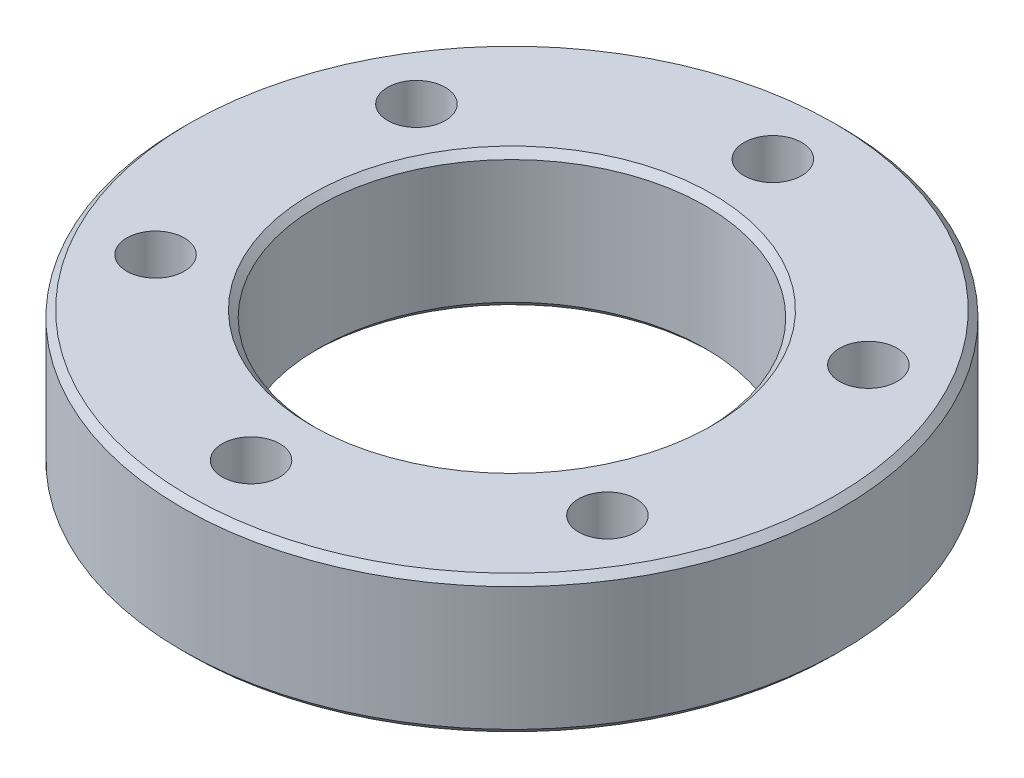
ISO-10303-21;
HEADER;
FILE_DESCRIPTION(('STEP AP214'),'2;1');
FILE_NAME('part.step','',(''),(''),'','','');
FILE_SCHEMA(('AUTOMOTIVE_DESIGN { 1 0 10303 214 1 1 1 1 }'));
ENDSEC;
DATA;
#1=APPLICATION_CONTEXT('core data for automotive mechanical design processes');
#2=APPLICATION_PROTOCOL_DEFINITION('international standard','automotive_design',2000,#1);
#3=PRODUCT_CONTEXT('',#1,'mechanical');
#4=PRODUCT('Part','Part','',(#3));
#5=PRODUCT_RELATED_PRODUCT_CATEGORY('part','',(#4));
#6=PRODUCT_DEFINITION_FORMATION('','',#4);
#7=PRODUCT_DEFINITION_CONTEXT('part definition',#1,'design');
#8=PRODUCT_DEFINITION('design','',#6,#7);
#9=PRODUCT_DEFINITION_SHAPE('','',#8);
#10=(LENGTH_UNIT() NAMED_UNIT(*) SI_UNIT(.MILLI.,.METRE.));
#11=(NAMED_UNIT(*) PLANE_ANGLE_UNIT() SI_UNIT($,.RADIAN.));
#12=(NAMED_UNIT(*) SI_UNIT($,.STERADIAN.) SOLID_ANGLE_UNIT());
#13=UNCERTAINTY_MEASURE_WITH_UNIT(LENGTH_MEASURE(1.E-05),#10,'distance_accuracy_value','');
#14=(GEOMETRIC_REPRESENTATION_CONTEXT(3) GLOBAL_UNCERTAINTY_ASSIGNED_CONTEXT((#13)) GLOBAL_UNIT_ASSIGNED_CONTEXT((#10,
#11,#12)) REPRESENTATION_CONTEXT('',''));
#15=CARTESIAN_POINT('',(0.,0.,0.));
#16=DIRECTION('',(0.,0.,1.));
#17=DIRECTION('',(1.,0.,0.));
#18=AXIS2_PLACEMENT_3D('',#15,#16,#17);
#19=CARTESIAN_POINT('',(0.,10.,0.));
#20=DIRECTION('',(0.,1.,0.));
#21=DIRECTION('',(0.,0.,1.));
#22=AXIS2_PLACEMENT_3D('',#19,#20,#21);
#23=PLANE('',#22);
#24=CARTESIAN_POINT('',(0.,10.,0.));
#25=DIRECTION('',(0.,1.,0.));
#26=DIRECTION('',(0.,0.,1.));
#27=AXIS2_PLACEMENT_3D('',#24,#25,#26);
#28=CIRCLE('',#27,23.5);
#29=CARTESIAN_POINT('',(0.,10.,23.5));
#30=VERTEX_POINT('',#29);
#31=EDGE_CURVE('E54',#30,#30,#28,.T.);
#32=ORIENTED_EDGE('',*,*,#31,.T.);
#33=EDGE_LOOP('',(#32));
#34=FACE_BOUND('',#33,.T.);
#35=CARTESIAN_POINT('',(0.,10.,0.));
#36=DIRECTION('',(0.,1.,0.));
#37=DIRECTION('',(0.,0.,1.));
#38=AXIS2_PLACEMENT_3D('',#35,#36,#37);
#39=CIRCLE('',#38,14.6);
#40=CARTESIAN_POINT('',(0.,10.,14.6));
#41=VERTEX_POINT('',#40);
#42=EDGE_CURVE('E58',#41,#41,#39,.F.);
#43=ORIENTED_EDGE('',*,*,#42,.T.);
#44=EDGE_LOOP('',(#43));
#45=FACE_BOUND('',#44,.T.);
#46=CARTESIAN_POINT('',(-16.4544826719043,10.0000000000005,-9.50000000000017));
#47=DIRECTION('',(0.,1.,0.));
#48=DIRECTION('',(0.,0.,1.));
#49=AXIS2_PLACEMENT_3D('',#46,#47,#48);
#50=CIRCLE('',#49,2.1);
#51=CARTESIAN_POINT('',(-16.4544826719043,10.0000000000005,-7.40000000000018));
#52=VERTEX_POINT('',#51);
#53=EDGE_CURVE('E108',#52,#52,#50,.T.);
#54=ORIENTED_EDGE('',*,*,#53,.F.);
#55=EDGE_LOOP('',(#54));
#56=FACE_BOUND('',#55,.T.);
#57=CARTESIAN_POINT('',(-16.4544826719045,10.0000000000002,9.49999999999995));
#58=DIRECTION('',(0.,1.,0.));
#59=DIRECTION('',(0.,0.,1.));
#60=AXIS2_PLACEMENT_3D('',#57,#58,#59);
#61=CIRCLE('',#60,2.1);
#62=CARTESIAN_POINT('',(-16.4544826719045,10.0000000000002,11.6));
#63=VERTEX_POINT('',#62);
#64=EDGE_CURVE('E102',#63,#63,#61,.T.);
#65=ORIENTED_EDGE('',*,*,#64,.F.);
#66=EDGE_LOOP('',(#65));
#67=FACE_BOUND('',#66,.T.);
#68=CARTESIAN_POINT('',(0.,10.0000000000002,19.0000000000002));
#69=DIRECTION('',(0.,1.,0.));
#70=DIRECTION('',(0.,0.,1.));
#71=AXIS2_PLACEMENT_3D('',#68,#69,#70);
#72=CIRCLE('',#71,2.1);
#73=CARTESIAN_POINT('',(0.,10.0000000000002,21.1000000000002));
#74=VERTEX_POINT('',#73);
#75=EDGE_CURVE('E96',#74,#74,#72,.T.);
#76=ORIENTED_EDGE('',*,*,#75,.F.);
#77=EDGE_LOOP('',(#76));
#78=FACE_BOUND('',#77,.T.);
#79=CARTESIAN_POINT('',(16.4544826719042,10.,9.50000000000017));
#80=DIRECTION('',(0.,1.,0.));
#81=DIRECTION('',(0.,0.,1.));
#82=AXIS2_PLACEMENT_3D('',#79,#80,#81);
#83=CIRCLE('',#82,2.1);
#84=CARTESIAN_POINT('',(16.4544826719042,10.,11.6000000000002));
#85=VERTEX_POINT('',#84);
#86=EDGE_CURVE('E90',#85,#85,#83,.T.);
#87=ORIENTED_EDGE('',*,*,#86,.F.);
#88=EDGE_LOOP('',(#87));
#89=FACE_BOUND('',#88,.T.);
#90=CARTESIAN_POINT('',(16.4544826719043,10.,-9.49999999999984));
#91=DIRECTION('',(0.,1.,0.));
#92=DIRECTION('',(0.,0.,1.));
#93=AXIS2_PLACEMENT_3D('',#90,#91,#92);
#94=CIRCLE('',#93,2.1);
#95=CARTESIAN_POINT('',(16.4544826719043,10.,-7.39999999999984));
#96=VERTEX_POINT('',#95);
#97=EDGE_CURVE('E84',#96,#96,#94,.T.);
#98=ORIENTED_EDGE('',*,*,#97,.F.);
#99=EDGE_LOOP('',(#98));
#100=FACE_BOUND('',#99,.T.);
#101=CARTESIAN_POINT('',(0.,10.,-19.));
#102=DIRECTION('',(0.,1.,0.));
#103=DIRECTION('',(0.,0.,1.));
#104=AXIS2_PLACEMENT_3D('',#101,#102,#103);
#105=CIRCLE('',#104,2.1);
#106=CARTESIAN_POINT('',(0.,10.,-16.9));
#107=VERTEX_POINT('',#106);
#108=EDGE_CURVE('E78',#107,#107,#105,.T.);
#109=ORIENTED_EDGE('',*,*,#108,.F.);
#110=EDGE_LOOP('',(#109));
#111=FACE_BOUND('',#110,.T.);
#112=ADVANCED_FACE('F43',(#34,#45,#56,#67,#78,#89,#100,#111),#23,.T.);
#113=CARTESIAN_POINT('',(0.,0.,0.));
#114=DIRECTION('',(0.,1.,0.));
#115=DIRECTION('',(0.,0.,1.));
#116=AXIS2_PLACEMENT_3D('',#113,#114,#115);
#117=PLANE('',#116);
#118=CARTESIAN_POINT('',(0.,0.,0.));
#119=DIRECTION('',(0.,1.,0.));
#120=DIRECTION('',(0.,0.,1.));
#121=AXIS2_PLACEMENT_3D('',#118,#119,#120);
#122=CIRCLE('',#121,23.5);
#123=CARTESIAN_POINT('',(0.,0.,23.5));
#124=VERTEX_POINT('',#123);
#125=EDGE_CURVE('E63',#124,#124,#122,.F.);
#126=ORIENTED_EDGE('',*,*,#125,.T.);
#127=EDGE_LOOP('',(#126));
#128=FACE_BOUND('',#127,.T.);
#129=CARTESIAN_POINT('',(0.,0.,0.));
#130=DIRECTION('',(0.,1.,0.));
#131=DIRECTION('',(0.,0.,1.));
#132=AXIS2_PLACEMENT_3D('',#129,#130,#131);
#133=CIRCLE('',#132,14.6);
#134=CARTESIAN_POINT('',(0.,0.,14.6));
#135=VERTEX_POINT('',#134);
#136=EDGE_CURVE('E66',#135,#135,#133,.T.);
#137=ORIENTED_EDGE('',*,*,#136,.T.);
#138=EDGE_LOOP('',(#137));
#139=FACE_BOUND('',#138,.T.);
#140=CARTESIAN_POINT('',(-16.4544826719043,4.44089209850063E-13,-9.50000000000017));
#141=DIRECTION('',(0.,1.,0.));
#142=DIRECTION('',(0.,0.,1.));
#143=AXIS2_PLACEMENT_3D('',#140,#141,#142);
#144=CIRCLE('',#143,2.1);
#145=CARTESIAN_POINT('',(-16.4544826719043,4.43883065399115E-13,-7.40000000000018));
#146=VERTEX_POINT('',#145);
#147=EDGE_CURVE('E105',#146,#146,#144,.T.);
#148=ORIENTED_EDGE('',*,*,#147,.T.);
#149=EDGE_LOOP('',(#148));
#150=FACE_BOUND('',#149,.T.);
#151=CARTESIAN_POINT('',(-16.4544826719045,2.22044604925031E-13,9.49999999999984));
#152=DIRECTION('',(0.,1.,0.));
#153=DIRECTION('',(0.,0.,1.));
#154=AXIS2_PLACEMENT_3D('',#151,#152,#153);
#155=CIRCLE('',#154,2.1);
#156=CARTESIAN_POINT('',(-16.4544826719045,2.21838460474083E-13,11.5999999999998));
#157=VERTEX_POINT('',#156);
#158=EDGE_CURVE('E99',#157,#157,#155,.T.);
#159=ORIENTED_EDGE('',*,*,#158,.T.);
#160=EDGE_LOOP('',(#159));
#161=FACE_BOUND('',#160,.T.);
#162=CARTESIAN_POINT('',(-1.66533453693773E-13,2.22044604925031E-13,19.0000000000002));
#163=DIRECTION('',(0.,1.,0.));
#164=DIRECTION('',(0.,0.,1.));
#165=AXIS2_PLACEMENT_3D('',#162,#163,#164);
#166=CIRCLE('',#165,2.1);
#167=CARTESIAN_POINT('',(-1.65600866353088E-13,2.21838460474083E-13,21.1000000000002));
#168=VERTEX_POINT('',#167);
#169=EDGE_CURVE('E93',#168,#168,#166,.T.);
#170=ORIENTED_EDGE('',*,*,#169,.T.);
#171=EDGE_LOOP('',(#170));
#172=FACE_BOUND('',#171,.T.);
#173=CARTESIAN_POINT('',(16.4544826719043,0.,9.50000000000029));
#174=DIRECTION('',(0.,1.,0.));
#175=DIRECTION('',(0.,0.,1.));
#176=AXIS2_PLACEMENT_3D('',#173,#174,#175);
#177=CIRCLE('',#176,2.1);
#178=CARTESIAN_POINT('',(16.4544826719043,0.,11.6000000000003));
#179=VERTEX_POINT('',#178);
#180=EDGE_CURVE('E87',#179,#179,#177,.T.);
#181=ORIENTED_EDGE('',*,*,#180,.T.);
#182=EDGE_LOOP('',(#181));
#183=FACE_BOUND('',#182,.T.);
#184=CARTESIAN_POINT('',(16.4544826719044,0.,-9.49999999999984));
#185=DIRECTION('',(0.,1.,0.));
#186=DIRECTION('',(0.,0.,1.));
#187=AXIS2_PLACEMENT_3D('',#184,#185,#186);
#188=CIRCLE('',#187,2.1);
#189=CARTESIAN_POINT('',(16.4544826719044,0.,-7.39999999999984));
#190=VERTEX_POINT('',#189);
#191=EDGE_CURVE('E81',#190,#190,#188,.T.);
#192=ORIENTED_EDGE('',*,*,#191,.T.);
#193=EDGE_LOOP('',(#192));
#194=FACE_BOUND('',#193,.T.);
#195=CARTESIAN_POINT('',(0.,0.,-19.));
#196=DIRECTION('',(0.,1.,0.));
#197=DIRECTION('',(0.,0.,1.));
#198=AXIS2_PLACEMENT_3D('',#195,#196,#197);
#199=CIRCLE('',#198,2.1);
#200=CARTESIAN_POINT('',(0.,0.,-16.9));
#201=VERTEX_POINT('',#200);
#202=EDGE_CURVE('E75',#201,#201,#199,.T.);
#203=ORIENTED_EDGE('',*,*,#202,.T.);
#204=EDGE_LOOP('',(#203));
#205=FACE_BOUND('',#204,.T.);
#206=ADVANCED_FACE('F116',(#128,#139,#150,#161,#172,#183,#194,#205),#117,.F.);
#207=CARTESIAN_POINT('',(0.,10.,0.));
#208=DIRECTION('',(0.,-1.,0.));
#209=DIRECTION('',(0.,0.,-1.));
#210=AXIS2_PLACEMENT_3D('',#207,#208,#209);
#211=CYLINDRICAL_SURFACE('',#210,24.);
#212=CARTESIAN_POINT('',(0.,0.499999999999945,0.));
#213=DIRECTION('',(0.,1.,0.));
#214=DIRECTION('',(0.,0.,1.));
#215=AXIS2_PLACEMENT_3D('',#212,#213,#214);
#216=CIRCLE('',#215,24.);
#217=CARTESIAN_POINT('',(0.,0.499999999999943,24.));
#218=VERTEX_POINT('',#217);
#219=EDGE_CURVE('E69',#218,#218,#216,.T.);
#220=ORIENTED_EDGE('',*,*,#219,.T.);
#221=EDGE_LOOP('',(#220));
#222=FACE_BOUND('',#221,.T.);
#223=CARTESIAN_POINT('',(0.,9.49999999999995,0.));
#224=DIRECTION('',(0.,1.,0.));
#225=DIRECTION('',(0.,0.,1.));
#226=AXIS2_PLACEMENT_3D('',#223,#224,#225);
#227=CIRCLE('',#226,24.);
#228=CARTESIAN_POINT('',(0.,9.49999999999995,24.));
#229=VERTEX_POINT('',#228);
#230=EDGE_CURVE('E72',#229,#229,#227,.F.);
#231=ORIENTED_EDGE('',*,*,#230,.T.);
#232=EDGE_LOOP('',(#231));
#233=FACE_BOUND('',#232,.T.);
#234=ADVANCED_FACE('F142',(#222,#233),#211,.T.);
#235=CARTESIAN_POINT('',(0.,10.,0.));
#236=DIRECTION('',(0.,-1.,0.));
#237=DIRECTION('',(0.,0.,-1.));
#238=AXIS2_PLACEMENT_3D('',#235,#236,#237);
#239=CYLINDRICAL_SURFACE('',#238,14.1);
#240=CARTESIAN_POINT('',(0.,0.500000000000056,0.));
#241=DIRECTION('',(0.,1.,0.));
#242=DIRECTION('',(0.,0.,1.));
#243=AXIS2_PLACEMENT_3D('',#240,#241,#242);
#244=CIRCLE('',#243,14.1);
#245=CARTESIAN_POINT('',(0.,0.500000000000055,14.1));
#246=VERTEX_POINT('',#245);
#247=EDGE_CURVE('E10',#246,#246,#244,.F.);
#248=ORIENTED_EDGE('',*,*,#247,.T.);
#249=EDGE_LOOP('',(#248));
#250=FACE_BOUND('',#249,.T.);
#251=CARTESIAN_POINT('',(0.,9.50000000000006,0.));
#252=DIRECTION('',(0.,1.,0.));
#253=DIRECTION('',(0.,0.,1.));
#254=AXIS2_PLACEMENT_3D('',#251,#252,#253);
#255=CIRCLE('',#254,14.1);
#256=CARTESIAN_POINT('',(0.,9.50000000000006,14.1));
#257=VERTEX_POINT('',#256);
#258=EDGE_CURVE('E50',#257,#257,#255,.T.);
#259=ORIENTED_EDGE('',*,*,#258,.T.);
#260=EDGE_LOOP('',(#259));
#261=FACE_BOUND('',#260,.T.);
#262=ADVANCED_FACE('F132',(#250,#261),#239,.F.);
#263=CARTESIAN_POINT('',(0.,10.,-19.));
#264=DIRECTION('',(0.,1.,0.));
#265=DIRECTION('',(0.,0.,1.));
#266=AXIS2_PLACEMENT_3D('',#263,#264,#265);
#267=CYLINDRICAL_SURFACE('',#266,2.1);
#268=ORIENTED_EDGE('',*,*,#202,.F.);
#269=EDGE_LOOP('',(#268));
#270=FACE_BOUND('',#269,.T.);
#271=ORIENTED_EDGE('',*,*,#108,.T.);
#272=EDGE_LOOP('',(#271));
#273=FACE_BOUND('',#272,.T.);
#274=ADVANCED_FACE('F129',(#270,#273),#267,.F.);
#275=CARTESIAN_POINT('',(16.4544826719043,10.,-9.49999999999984));
#276=DIRECTION('',(0.,1.,0.));
#277=DIRECTION('',(0.,0.,1.));
#278=AXIS2_PLACEMENT_3D('',#275,#276,#277);
#279=CYLINDRICAL_SURFACE('',#278,2.1);
#280=ORIENTED_EDGE('',*,*,#191,.F.);
#281=EDGE_LOOP('',(#280));
#282=FACE_BOUND('',#281,.T.);
#283=ORIENTED_EDGE('',*,*,#97,.T.);
#284=EDGE_LOOP('',(#283));
#285=FACE_BOUND('',#284,.T.);
#286=ADVANCED_FACE('F131',(#282,#285),#279,.F.);
#287=CARTESIAN_POINT('',(16.4544826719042,10.,9.50000000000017));
#288=DIRECTION('',(0.,1.,0.));
#289=DIRECTION('',(0.,0.,1.));
#290=AXIS2_PLACEMENT_3D('',#287,#288,#289);
#291=CYLINDRICAL_SURFACE('',#290,2.1);
#292=ORIENTED_EDGE('',*,*,#180,.F.);
#293=EDGE_LOOP('',(#292));
#294=FACE_BOUND('',#293,.T.);
#295=ORIENTED_EDGE('',*,*,#86,.T.);
#296=EDGE_LOOP('',(#295));
#297=FACE_BOUND('',#296,.T.);
#298=ADVANCED_FACE('F139',(#294,#297),#291,.F.);
#299=CARTESIAN_POINT('',(0.,10.0000000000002,19.0000000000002));
#300=DIRECTION('',(0.,1.,0.));
#301=DIRECTION('',(0.,0.,1.));
#302=AXIS2_PLACEMENT_3D('',#299,#300,#301);
#303=CYLINDRICAL_SURFACE('',#302,2.1);
#304=ORIENTED_EDGE('',*,*,#169,.F.);
#305=EDGE_LOOP('',(#304));
#306=FACE_BOUND('',#305,.T.);
#307=ORIENTED_EDGE('',*,*,#75,.T.);
#308=EDGE_LOOP('',(#307));
#309=FACE_BOUND('',#308,.T.);
#310=ADVANCED_FACE('F185',(#306,#309),#303,.F.);
#311=CARTESIAN_POINT('',(-16.4544826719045,10.0000000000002,9.49999999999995));
#312=DIRECTION('',(0.,1.,0.));
#313=DIRECTION('',(0.,0.,1.));
#314=AXIS2_PLACEMENT_3D('',#311,#312,#313);
#315=CYLINDRICAL_SURFACE('',#314,2.1);
#316=ORIENTED_EDGE('',*,*,#158,.F.);
#317=EDGE_LOOP('',(#316));
#318=FACE_BOUND('',#317,.T.);
#319=ORIENTED_EDGE('',*,*,#64,.T.);
#320=EDGE_LOOP('',(#319));
#321=FACE_BOUND('',#320,.T.);
#322=ADVANCED_FACE('F189',(#318,#321),#315,.F.);
#323=CARTESIAN_POINT('',(-16.4544826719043,10.0000000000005,-9.50000000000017));
#324=DIRECTION('',(0.,1.,0.));
#325=DIRECTION('',(0.,0.,1.));
#326=AXIS2_PLACEMENT_3D('',#323,#324,#325);
#327=CYLINDRICAL_SURFACE('',#326,2.1);
#328=ORIENTED_EDGE('',*,*,#147,.F.);
#329=EDGE_LOOP('',(#328));
#330=FACE_BOUND('',#329,.T.);
#331=ORIENTED_EDGE('',*,*,#53,.T.);
#332=EDGE_LOOP('',(#331));
#333=FACE_BOUND('',#332,.T.);
#334=ADVANCED_FACE('F112',(#330,#333),#327,.F.);
#335=CARTESIAN_POINT('',(0.,0.499999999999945,0.));
#336=DIRECTION('',(0.,1.,0.));
#337=DIRECTION('',(0.,0.,1.));
#338=AXIS2_PLACEMENT_3D('',#335,#336,#337);
#339=CONICAL_SURFACE('',#338,24.,0.785398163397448);
#340=ORIENTED_EDGE('',*,*,#125,.F.);
#341=EDGE_LOOP('',(#340));
#342=FACE_BOUND('',#341,.T.);
#343=ORIENTED_EDGE('',*,*,#219,.F.);
#344=EDGE_LOOP('',(#343));
#345=FACE_BOUND('',#344,.T.);
#346=ADVANCED_FACE('F153',(#342,#345),#339,.T.);
#347=CARTESIAN_POINT('',(0.,10.,0.));
#348=DIRECTION('',(0.,-1.,0.));
#349=DIRECTION('',(0.,0.,-1.));
#350=AXIS2_PLACEMENT_3D('',#347,#348,#349);
#351=CONICAL_SURFACE('',#350,23.5,0.785398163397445);
#352=ORIENTED_EDGE('',*,*,#230,.F.);
#353=EDGE_LOOP('',(#352));
#354=FACE_BOUND('',#353,.T.);
#355=ORIENTED_EDGE('',*,*,#31,.F.);
#356=EDGE_LOOP('',(#355));
#357=FACE_BOUND('',#356,.T.);
#358=ADVANCED_FACE('F156',(#354,#357),#351,.T.);
#359=CARTESIAN_POINT('',(0.,0.,0.));
#360=DIRECTION('',(0.,-1.,0.));
#361=DIRECTION('',(0.,0.,-1.));
#362=AXIS2_PLACEMENT_3D('',#359,#360,#361);
#363=CONICAL_SURFACE('',#362,14.6,0.785398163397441);
#364=ORIENTED_EDGE('',*,*,#247,.F.);
#365=EDGE_LOOP('',(#364));
#366=FACE_BOUND('',#365,.T.);
#367=ORIENTED_EDGE('',*,*,#136,.F.);
#368=EDGE_LOOP('',(#367));
#369=FACE_BOUND('',#368,.T.);
#370=ADVANCED_FACE('F159',(#366,#369),#363,.F.);
#371=CARTESIAN_POINT('',(0.,9.50000000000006,0.));
#372=DIRECTION('',(0.,1.,0.));
#373=DIRECTION('',(0.,0.,1.));
#374=AXIS2_PLACEMENT_3D('',#371,#372,#373);
#375=CONICAL_SURFACE('',#374,14.1,0.785398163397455);
#376=ORIENTED_EDGE('',*,*,#42,.F.);
#377=EDGE_LOOP('',(#376));
#378=FACE_BOUND('',#377,.T.);
#379=ORIENTED_EDGE('',*,*,#258,.F.);
#380=EDGE_LOOP('',(#379));
#381=FACE_BOUND('',#380,.T.);
#382=ADVANCED_FACE('F45',(#378,#381),#375,.F.);
#383=CLOSED_SHELL('',(#112,#206,#234,#262,#274,#286,#298,#310,#322,#334,#346,#358,#370,#382));
#384=MANIFOLD_SOLID_BREP('B2',#383);
#385=ADVANCED_BREP_SHAPE_REPRESENTATION('',(#18,#384),#14);
#386=SHAPE_DEFINITION_REPRESENTATION(#9,#385);
ENDSEC;
END-ISO-10303-21;
